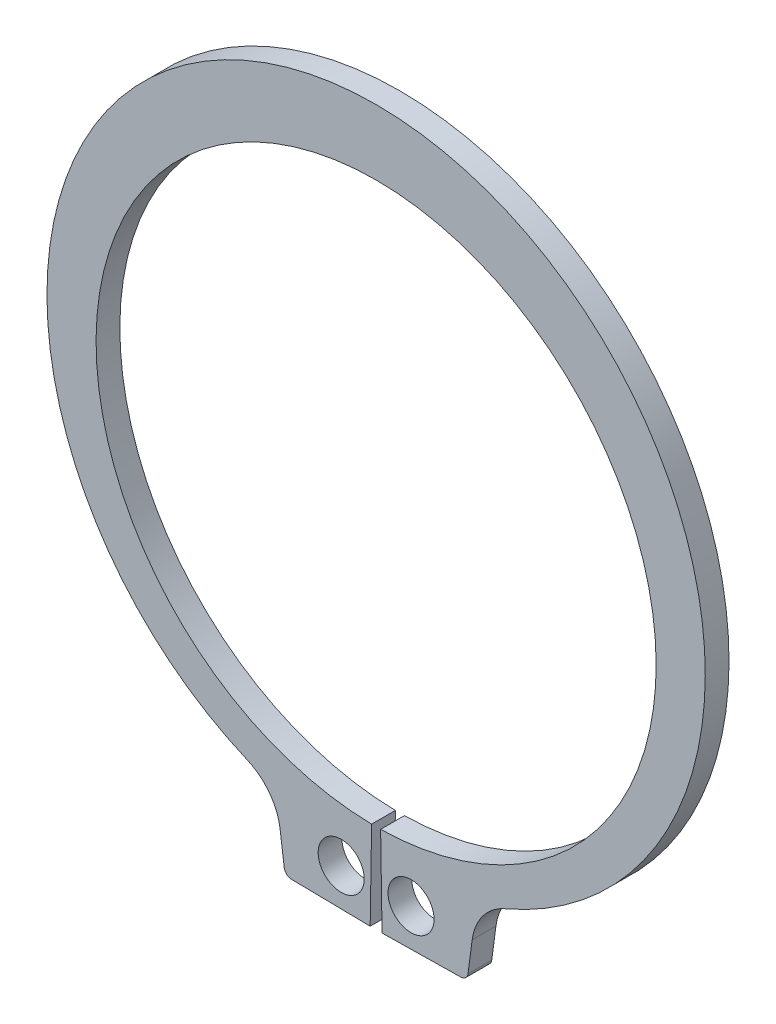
from build123d import *

# Parameters (mm, degrees)
BODYSKE_R  = 1.55
BODY_DEPTH = 0.8


with BuildPart() as part:
    # BodySke → Body (new, symmetric)
    with BuildSketch(Plane.XY):
        with BuildLine():
            Line((0.303420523, -18.847557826), (0.4, -24.846780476))
            Line((0.4, -24.846780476), (5.697284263, -24.76150127))
            ThreePointArc((5.697284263, -24.76150127), (6.021923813, -24.634820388), (6.184958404, -24.326829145))
            Line((6.184958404, -24.326829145), (6.463914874, -22.207944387))
            ThreePointArc((6.463914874, -22.207944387), (7.185532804, -20.453444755), (8.681925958, -19.287336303))
            ThreePointArc((8.681925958, -19.287336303), (0, 23.25), (-8.681925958, -19.287336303))
            ThreePointArc((-8.681925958, -19.287336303), (-7.185532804, -20.453444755), (-6.463914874, -22.207944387))
            Line((-6.463914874, -22.207944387), (-6.184958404, -24.326829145))
            ThreePointArc((-6.184958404, -24.326829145), (-6.021923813, -24.634820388), (-5.697284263, -24.76150127))
            Line((-5.697284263, -24.76150127), (-0.4, -24.846780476))
            Line((-0.4, -24.846780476), (-0.303420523, -18.847557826))
            ThreePointArc((-0.303420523, -18.847557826), (0, 18.85), (0.303420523, -18.847557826))
        make_face()
        with Locations((2.35, -22.301527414)):
            Circle(BODYSKE_R, mode=Mode.SUBTRACT)
        with Locations((-2.35, -22.301527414)):
            Circle(BODYSKE_R, mode=Mode.SUBTRACT)
    extrude(amount=BODY_DEPTH, both=True)


solid = part.part
